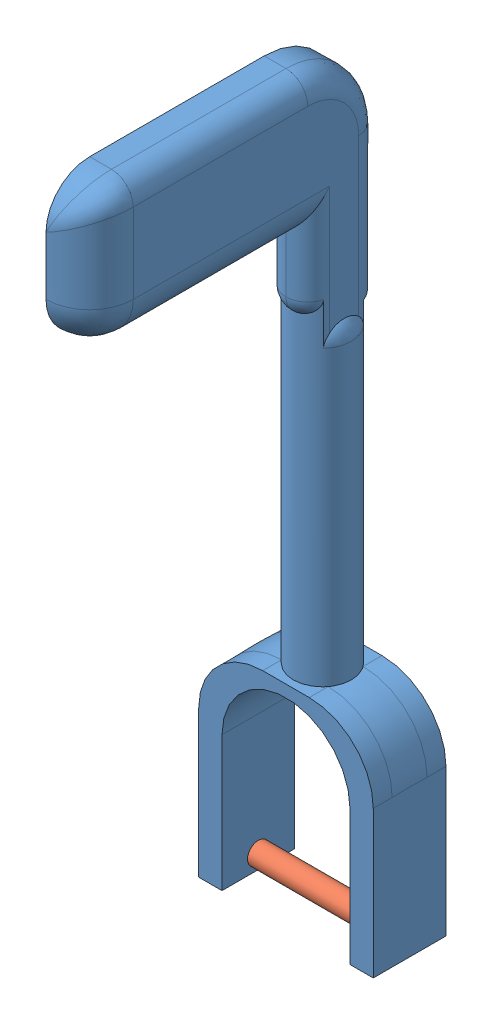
SolidWorks assembly Rear gear assembly.SLDASM, configuration Default (file format 11000). Lengths in mm.
Overall size (30.48 130.07 51.01).
2 component instances, 2 part files, 2 mates.
Components (placement in the parent):
- Rear gear-1: Rear gear.SLDPRT [Default] at (48.8669 40.9652 79.7174) size (30.48 129.94 51.01)
- Axel-1: Axel.SLDPRT [Default] at (36.4209 6.6752 79.7174) x (0 -0.792499 -0.609874) z (0 -0.609874 0.792499) size (3.81 24.89 3.81)
Mates (geometry in assembly coordinates):
- Concentric1: concentric: cylinder of Rear gear-1 through (36.4209 6.6752 79.7174) axis (1 0 0) radius 1.905; cylinder of Axel-1 through (61.3129 6.6752 79.7174) axis (-1 0 0) radius 1.905
- Coincident1: coincident: plane of Rear gear-1 through (61.3129 6.6752 79.7174) normal (-1 0 0); plane of Axel-1 through (61.3129 6.6752 79.7174) normal (1 0 0)
